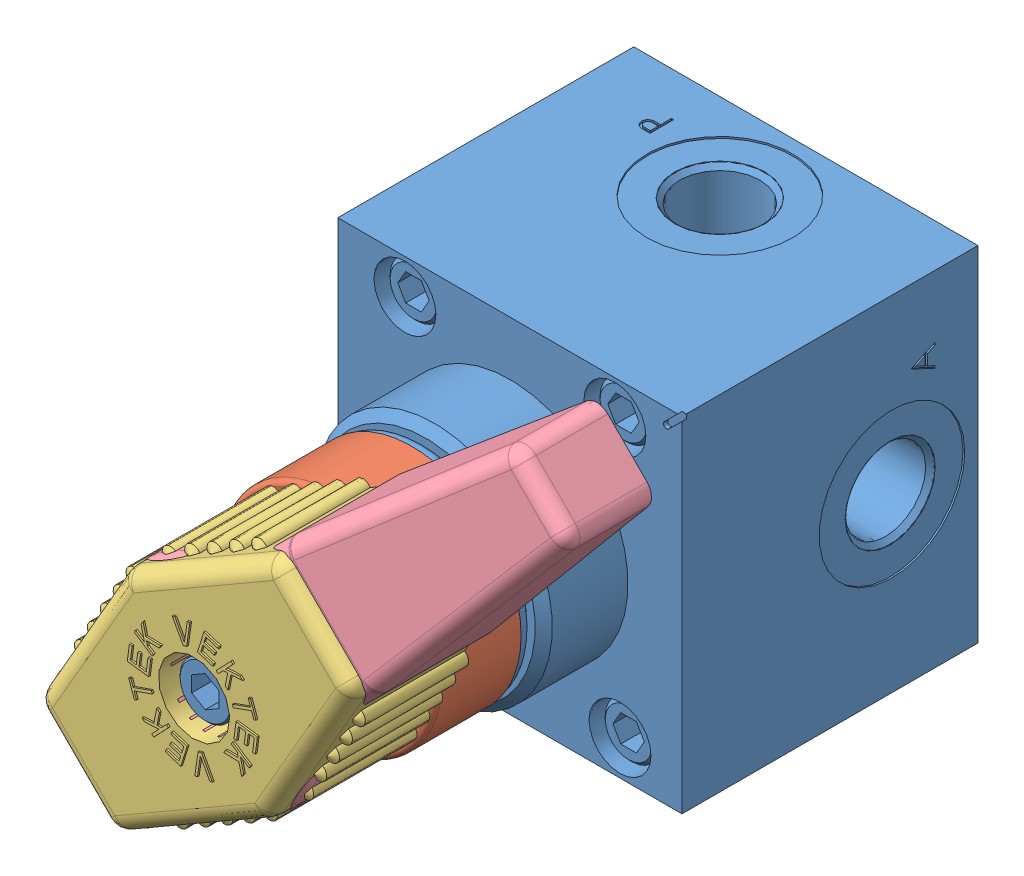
SolidWorks assembly ILCMV43134721.SLDASM, configuration Default (file format 5000). Lengths in mm.
Overall size (58.16 58.16 90.87).
4 component instances, 4 part files, 9 mates.
Components (placement in the parent):
- ILCMV43134721_BASE-1: ILCMV43134721_BASE.sldprt [Default] at (-59.2599 -12.2391 -8.5905) size (50.8 50.8 88.65)
- ILCMV43134721_ADAPTER-1: ILCMV43134721_ADAPTER.sldprt [Default] at (-84.6599 13.1609 70.7845) x (0 0 -1) z (1 0 0) size (22.23 32.26 32.26)
- 85600903-1: 85600903.sldprt [Default] at (-84.6599 13.1609 81.7065) x (0.707107 0.707107 0) z (0.707107 -0.707107 0) size (51.61 19.62 30.64)
- 85600902-1: 85600902.SLDPRT [Default] at (-84.6599 13.1609 62.6565) x (0 0 1) z (0.707107 -0.707107 0) size (17.76 89.76 30.23) (hidden)
Mates (geometry in assembly coordinates):
- Concentric1: concentric anti-aligned: cylinder of ILCMV43134721_BASE-1 through (-84.6599 13.1609 80.7731) axis (0 0 -1) radius 3.9624; cylinder of ILCMV43134721_ADAPTER-1 through (-84.6599 13.1609 42.48) axis (0 0 1) radius 6.35
- Coincident1: coincident anti-aligned: plane of ILCMV43134721_BASE-1 through (-84.6599 13.1609 48.5595) normal (0 0 1); plane of ILCMV43134721_ADAPTER-1 through (-84.6599 13.1609 48.5595) normal (0 0 -1)
- Parallel1: parallel aligned: plane of ILCMV43134721_BASE-1 through (-61.2284 35.9574 35.0975) normal (-0.707107 0.707107 0); plane of ILCMV43134721_ADAPTER-1 through (-95.6581 17.7165 70.7845) normal (-0.707107 0.707107 0)
- Concentric2: concentric anti-aligned: cylinder of ILCMV43134721_BASE-1 through (-84.6599 13.1609 80.7731) axis (0 0 -1) radius 3.9624; cylinder of 85600903-1 through (-84.6599 13.1609 53.41) axis (0 0 1) radius 5.2705
- Parallel3: parallel anti-aligned: plane of ILCMV43134721_ADAPTER-1 through (-95.6581 17.7165 70.7845) normal (-0.707107 0.707107 0); plane of 85600903-1 through (-95.8359 17.7901 62.6565) normal (0.707107 -0.707107 0)
- Coincident9: coincident anti-aligned: plane of ILCMV43134721_ADAPTER-1 through (-84.6599 13.1609 70.7845) normal (0 0 1); plane of 85600903-1 through (-84.6599 13.1609 70.7845) normal (0 0 -1)
- Concentric3: concentric anti-aligned: cylinder of ILCMV43134721_BASE-1 through (-84.6599 13.1609 80.7731) axis (0 0 -1) radius 3.9624; cylinder of 85600902-1 through (-84.6599 13.1609 66.5935) axis (0 0 1) radius 5.2705
- Parallel5: parallel anti-aligned: plane of ILCMV43134721_ADAPTER-1 through (-95.6581 17.7165 70.7845) normal (-0.707107 0.707107 0); plane of 85600902-1 through (-95.8359 17.7901 62.6565) normal (0.707107 -0.707107 0)
- Coincident12: coincident anti-aligned: plane of ILCMV43134721_ADAPTER-1 through (-84.6599 13.1609 70.7845) normal (0 0 1); plane of 85600902-1 through (-84.6599 13.1609 70.7845) normal (0 0 -1)
